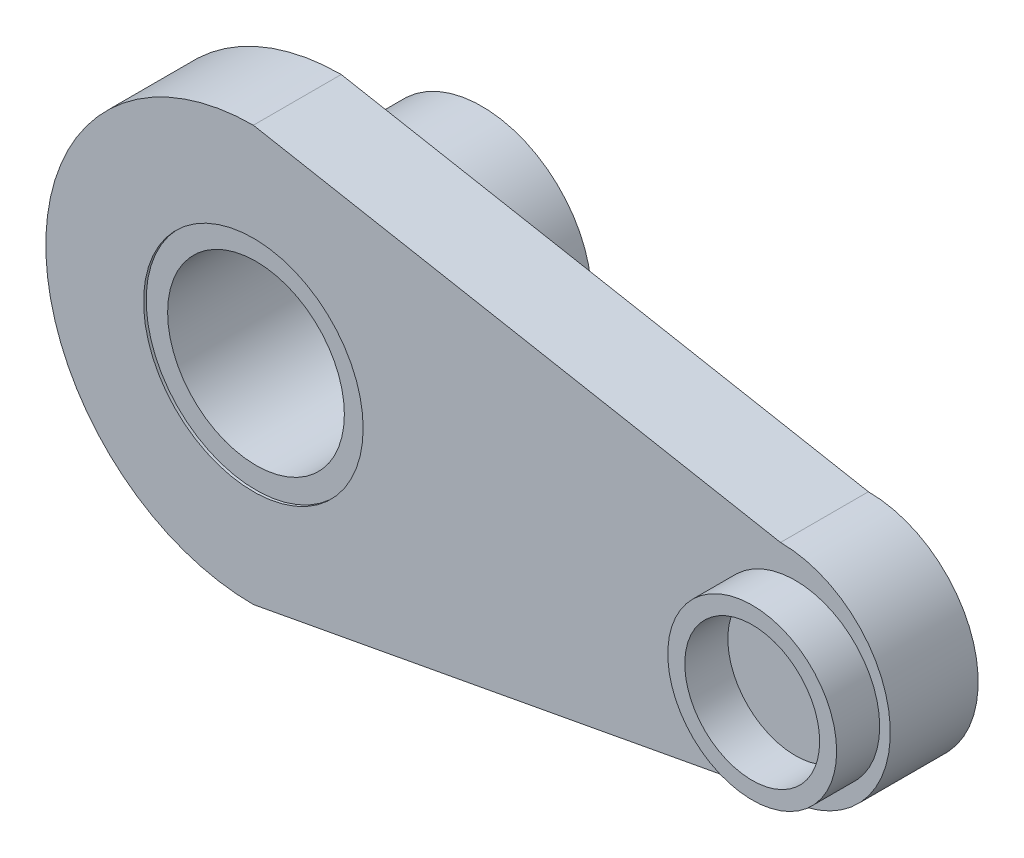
ISO-10303-21;
HEADER;
FILE_DESCRIPTION(('STEP AP214'),'2;1');
FILE_NAME('part.step','',(''),(''),'','','');
FILE_SCHEMA(('AUTOMOTIVE_DESIGN { 1 0 10303 214 1 1 1 1 }'));
ENDSEC;
DATA;
#1=APPLICATION_CONTEXT('core data for automotive mechanical design processes');
#2=APPLICATION_PROTOCOL_DEFINITION('international standard','automotive_design',2000,#1);
#3=PRODUCT_CONTEXT('',#1,'mechanical');
#4=PRODUCT('Part','Part','',(#3));
#5=PRODUCT_RELATED_PRODUCT_CATEGORY('part','',(#4));
#6=PRODUCT_DEFINITION_FORMATION('','',#4);
#7=PRODUCT_DEFINITION_CONTEXT('part definition',#1,'design');
#8=PRODUCT_DEFINITION('design','',#6,#7);
#9=PRODUCT_DEFINITION_SHAPE('','',#8);
#10=(LENGTH_UNIT() NAMED_UNIT(*) SI_UNIT(.MILLI.,.METRE.));
#11=(NAMED_UNIT(*) PLANE_ANGLE_UNIT() SI_UNIT($,.RADIAN.));
#12=(NAMED_UNIT(*) SI_UNIT($,.STERADIAN.) SOLID_ANGLE_UNIT());
#13=UNCERTAINTY_MEASURE_WITH_UNIT(LENGTH_MEASURE(1.E-05),#10,'distance_accuracy_value','');
#14=(GEOMETRIC_REPRESENTATION_CONTEXT(3) GLOBAL_UNCERTAINTY_ASSIGNED_CONTEXT((#13)) GLOBAL_UNIT_ASSIGNED_CONTEXT((#10,
#11,#12)) REPRESENTATION_CONTEXT('',''));
#15=CARTESIAN_POINT('',(0.,0.,0.));
#16=DIRECTION('',(0.,0.,1.));
#17=DIRECTION('',(1.,0.,0.));
#18=AXIS2_PLACEMENT_3D('',#15,#16,#17);
#19=CARTESIAN_POINT('',(15.1887409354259,-53.239975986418,0.));
#20=DIRECTION('',(0.,0.,1.));
#21=DIRECTION('',(1.,0.,0.));
#22=AXIS2_PLACEMENT_3D('',#19,#20,#21);
#23=PLANE('',#22);
#24=CARTESIAN_POINT('',(38.1,0.,0.));
#25=DIRECTION('',(0.,0.,1.));
#26=DIRECTION('',(1.,0.,0.));
#27=AXIS2_PLACEMENT_3D('',#24,#25,#26);
#28=CIRCLE('',#27,7.935);
#29=CARTESIAN_POINT('',(38.1,-7.93500000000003,0.));
#30=VERTEX_POINT('',#29);
#31=CARTESIAN_POINT('',(38.1,7.935,0.));
#32=VERTEX_POINT('',#31);
#33=EDGE_CURVE('E103',#30,#32,#28,.T.);
#34=ORIENTED_EDGE('',*,*,#33,.F.);
#35=DIRECTION('',(-0.983238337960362,-0.182324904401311,0.));
#36=VECTOR('',#35,1.);
#37=CARTESIAN_POINT('',(7.82859519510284,-13.5483195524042,0.));
#38=LINE('',#37,#36);
#39=CARTESIAN_POINT('',(0.,-15.,0.));
#40=VERTEX_POINT('',#39);
#41=EDGE_CURVE('E113',#30,#40,#38,.T.);
#42=ORIENTED_EDGE('',*,*,#41,.T.);
#43=CARTESIAN_POINT('',(0.,0.,0.));
#44=DIRECTION('',(0.,0.,1.));
#45=DIRECTION('',(1.,0.,0.));
#46=AXIS2_PLACEMENT_3D('',#43,#44,#45);
#47=CIRCLE('',#46,15.);
#48=CARTESIAN_POINT('',(0.,15.,0.));
#49=VERTEX_POINT('',#48);
#50=EDGE_CURVE('E111',#49,#40,#47,.T.);
#51=ORIENTED_EDGE('',*,*,#50,.F.);
#52=DIRECTION('',(0.983238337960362,-0.182324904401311,0.));
#53=VECTOR('',#52,1.);
#54=CARTESIAN_POINT('',(26.9171322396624,10.0086735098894,0.));
#55=LINE('',#54,#53);
#56=EDGE_CURVE('E96',#49,#32,#55,.T.);
#57=ORIENTED_EDGE('',*,*,#56,.T.);
#58=EDGE_LOOP('',(#34,#42,#51,#57));
#59=FACE_BOUND('',#58,.T.);
#60=CARTESIAN_POINT('',(0.,0.,0.));
#61=DIRECTION('',(0.,0.,1.));
#62=DIRECTION('',(1.,0.,0.));
#63=AXIS2_PLACEMENT_3D('',#60,#61,#62);
#64=CIRCLE('',#63,7.935);
#65=CARTESIAN_POINT('',(7.93500000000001,0.,0.));
#66=VERTEX_POINT('',#65);
#67=EDGE_CURVE('E13',#66,#66,#64,.F.);
#68=ORIENTED_EDGE('',*,*,#67,.F.);
#69=EDGE_LOOP('',(#68));
#70=FACE_BOUND('',#69,.T.);
#71=ADVANCED_FACE('F47',(#59,#70),#23,.F.);
#72=CARTESIAN_POINT('',(15.1887409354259,-53.239975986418,6.35000000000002));
#73=DIRECTION('',(0.,0.,1.));
#74=DIRECTION('',(1.,0.,0.));
#75=AXIS2_PLACEMENT_3D('',#72,#73,#74);
#76=PLANE('',#75);
#77=CARTESIAN_POINT('',(38.1,0.,6.35000000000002));
#78=DIRECTION('',(0.,0.,1.));
#79=DIRECTION('',(1.,0.,0.));
#80=AXIS2_PLACEMENT_3D('',#77,#78,#79);
#81=CIRCLE('',#80,7.935);
#82=CARTESIAN_POINT('',(38.1,-7.93500000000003,6.35000000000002));
#83=VERTEX_POINT('',#82);
#84=CARTESIAN_POINT('',(38.1,7.935,6.35000000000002));
#85=VERTEX_POINT('',#84);
#86=EDGE_CURVE('E118',#83,#85,#81,.T.);
#87=ORIENTED_EDGE('',*,*,#86,.T.);
#88=DIRECTION('',(0.983238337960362,-0.182324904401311,0.));
#89=VECTOR('',#88,1.);
#90=CARTESIAN_POINT('',(26.9171322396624,10.0086735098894,6.35000000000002));
#91=LINE('',#90,#89);
#92=CARTESIAN_POINT('',(0.,15.,6.35000000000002));
#93=VERTEX_POINT('',#92);
#94=EDGE_CURVE('E97',#93,#85,#91,.T.);
#95=ORIENTED_EDGE('',*,*,#94,.F.);
#96=CARTESIAN_POINT('',(0.,0.,6.35000000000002));
#97=DIRECTION('',(0.,0.,1.));
#98=DIRECTION('',(1.,0.,0.));
#99=AXIS2_PLACEMENT_3D('',#96,#97,#98);
#100=CIRCLE('',#99,15.);
#101=CARTESIAN_POINT('',(0.,-15.,6.35000000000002));
#102=VERTEX_POINT('',#101);
#103=EDGE_CURVE('E70',#93,#102,#100,.T.);
#104=ORIENTED_EDGE('',*,*,#103,.T.);
#105=DIRECTION('',(-0.983238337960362,-0.182324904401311,0.));
#106=VECTOR('',#105,1.);
#107=CARTESIAN_POINT('',(7.82859519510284,-13.5483195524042,6.35000000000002));
#108=LINE('',#107,#106);
#109=EDGE_CURVE('E122',#83,#102,#108,.T.);
#110=ORIENTED_EDGE('',*,*,#109,.F.);
#111=EDGE_LOOP('',(#87,#95,#104,#110));
#112=FACE_BOUND('',#111,.T.);
#113=CARTESIAN_POINT('',(0.,0.,6.35000000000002));
#114=DIRECTION('',(0.,0.,1.));
#115=DIRECTION('',(1.,0.,0.));
#116=AXIS2_PLACEMENT_3D('',#113,#114,#115);
#117=CIRCLE('',#116,7.935);
#118=CARTESIAN_POINT('',(7.93500000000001,0.,6.35000000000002));
#119=VERTEX_POINT('',#118);
#120=EDGE_CURVE('E124',#119,#119,#117,.T.);
#121=ORIENTED_EDGE('',*,*,#120,.F.);
#122=EDGE_LOOP('',(#121));
#123=FACE_BOUND('',#122,.T.);
#124=CARTESIAN_POINT('',(39.1648768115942,0.,6.35000000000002));
#125=DIRECTION('',(0.,0.,1.));
#126=DIRECTION('',(1.,0.,0.));
#127=AXIS2_PLACEMENT_3D('',#124,#125,#126);
#128=CIRCLE('',#127,6.10143424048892);
#129=CARTESIAN_POINT('',(45.2663110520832,0.,6.35000000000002));
#130=VERTEX_POINT('',#129);
#131=EDGE_CURVE('E153',#130,#130,#128,.T.);
#132=ORIENTED_EDGE('',*,*,#131,.F.);
#133=EDGE_LOOP('',(#132));
#134=FACE_BOUND('',#133,.T.);
#135=ADVANCED_FACE('F146',(#112,#123,#134),#76,.T.);
#136=CARTESIAN_POINT('',(38.1,0.,6.35000000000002));
#137=DIRECTION('',(0.,0.,-1.));
#138=DIRECTION('',(-1.,0.,0.));
#139=AXIS2_PLACEMENT_3D('',#136,#137,#138);
#140=CYLINDRICAL_SURFACE('',#139,7.935);
#141=ORIENTED_EDGE('',*,*,#33,.T.);
#142=DIRECTION('',(0.,0.,-1.));
#143=VECTOR('',#142,1.);
#144=CARTESIAN_POINT('',(38.1,7.935,6.35000000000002));
#145=LINE('',#144,#143);
#146=EDGE_CURVE('E92',#85,#32,#145,.T.);
#147=ORIENTED_EDGE('',*,*,#146,.F.);
#148=ORIENTED_EDGE('',*,*,#86,.F.);
#149=DIRECTION('',(0.,0.,-1.));
#150=VECTOR('',#149,1.);
#151=CARTESIAN_POINT('',(38.1,-7.93500000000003,6.35000000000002));
#152=LINE('',#151,#150);
#153=EDGE_CURVE('E62',#83,#30,#152,.T.);
#154=ORIENTED_EDGE('',*,*,#153,.T.);
#155=EDGE_LOOP('',(#141,#147,#148,#154));
#156=FACE_BOUND('',#155,.T.);
#157=ADVANCED_FACE('F49',(#156),#140,.T.);
#158=CARTESIAN_POINT('',(26.9171322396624,10.0086735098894,6.35000000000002));
#159=DIRECTION('',(0.182324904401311,0.983238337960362,0.));
#160=DIRECTION('',(-0.983238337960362,0.182324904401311,0.));
#161=AXIS2_PLACEMENT_3D('',#158,#159,#160);
#162=PLANE('',#161);
#163=ORIENTED_EDGE('',*,*,#56,.F.);
#164=DIRECTION('',(0.,0.,-1.));
#165=VECTOR('',#164,1.);
#166=CARTESIAN_POINT('',(0.,15.,6.35000000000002));
#167=LINE('',#166,#165);
#168=EDGE_CURVE('E100',#93,#49,#167,.T.);
#169=ORIENTED_EDGE('',*,*,#168,.F.);
#170=ORIENTED_EDGE('',*,*,#94,.T.);
#171=ORIENTED_EDGE('',*,*,#146,.T.);
#172=EDGE_LOOP('',(#163,#169,#170,#171));
#173=FACE_BOUND('',#172,.T.);
#174=ADVANCED_FACE('F94',(#173),#162,.T.);
#175=CARTESIAN_POINT('',(0.,0.,6.35000000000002));
#176=DIRECTION('',(0.,0.,-1.));
#177=DIRECTION('',(-1.,0.,0.));
#178=AXIS2_PLACEMENT_3D('',#175,#176,#177);
#179=CYLINDRICAL_SURFACE('',#178,15.);
#180=ORIENTED_EDGE('',*,*,#50,.T.);
#181=DIRECTION('',(0.,0.,-1.));
#182=VECTOR('',#181,1.);
#183=CARTESIAN_POINT('',(0.,-15.,6.35000000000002));
#184=LINE('',#183,#182);
#185=EDGE_CURVE('E128',#102,#40,#184,.T.);
#186=ORIENTED_EDGE('',*,*,#185,.F.);
#187=ORIENTED_EDGE('',*,*,#103,.F.);
#188=ORIENTED_EDGE('',*,*,#168,.T.);
#189=EDGE_LOOP('',(#180,#186,#187,#188));
#190=FACE_BOUND('',#189,.T.);
#191=ADVANCED_FACE('F199',(#190),#179,.T.);
#192=CARTESIAN_POINT('',(7.82859519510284,-13.5483195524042,6.35000000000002));
#193=DIRECTION('',(0.182324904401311,-0.983238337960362,0.));
#194=DIRECTION('',(0.983238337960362,0.182324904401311,0.));
#195=AXIS2_PLACEMENT_3D('',#192,#193,#194);
#196=PLANE('',#195);
#197=ORIENTED_EDGE('',*,*,#41,.F.);
#198=ORIENTED_EDGE('',*,*,#153,.F.);
#199=ORIENTED_EDGE('',*,*,#109,.T.);
#200=ORIENTED_EDGE('',*,*,#185,.T.);
#201=EDGE_LOOP('',(#197,#198,#199,#200));
#202=FACE_BOUND('',#201,.T.);
#203=ADVANCED_FACE('F142',(#202),#196,.T.);
#204=CARTESIAN_POINT('',(0.,0.,6.35000000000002));
#205=DIRECTION('',(0.,0.,-1.));
#206=DIRECTION('',(-1.,0.,0.));
#207=AXIS2_PLACEMENT_3D('',#204,#205,#206);
#208=CYLINDRICAL_SURFACE('',#207,7.935);
#209=CARTESIAN_POINT('',(0.,0.,6.16000000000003));
#210=DIRECTION('',(0.,0.,1.));
#211=DIRECTION('',(1.,0.,0.));
#212=AXIS2_PLACEMENT_3D('',#209,#210,#211);
#213=CIRCLE('',#212,7.935);
#214=CARTESIAN_POINT('',(7.93500000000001,0.,6.16000000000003));
#215=VERTEX_POINT('',#214);
#216=EDGE_CURVE('E55',#215,#215,#213,.T.);
#217=ORIENTED_EDGE('',*,*,#216,.F.);
#218=EDGE_LOOP('',(#217));
#219=FACE_BOUND('',#218,.T.);
#220=ORIENTED_EDGE('',*,*,#120,.T.);
#221=EDGE_LOOP('',(#220));
#222=FACE_BOUND('',#221,.T.);
#223=ADVANCED_FACE('F138',(#219,#222),#208,.F.);
#224=CARTESIAN_POINT('',(39.1648768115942,0.,9.46143401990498));
#225=DIRECTION('',(0.,0.,1.));
#226=DIRECTION('',(1.,0.,0.));
#227=AXIS2_PLACEMENT_3D('',#224,#225,#226);
#228=PLANE('',#227);
#229=CARTESIAN_POINT('',(39.1648768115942,0.,9.46143401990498));
#230=DIRECTION('',(0.,0.,1.));
#231=DIRECTION('',(1.,0.,0.));
#232=AXIS2_PLACEMENT_3D('',#229,#230,#231);
#233=CIRCLE('',#232,6.10143424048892);
#234=CARTESIAN_POINT('',(45.2663110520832,0.,9.46143401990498));
#235=VERTEX_POINT('',#234);
#236=EDGE_CURVE('E106',#235,#235,#233,.T.);
#237=ORIENTED_EDGE('',*,*,#236,.T.);
#238=EDGE_LOOP('',(#237));
#239=FACE_BOUND('',#238,.T.);
#240=CARTESIAN_POINT('',(39.1648768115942,0.,9.46143401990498));
#241=DIRECTION('',(0.,0.,1.));
#242=DIRECTION('',(1.,0.,0.));
#243=AXIS2_PLACEMENT_3D('',#240,#241,#242);
#244=CIRCLE('',#243,4.87323276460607);
#245=CARTESIAN_POINT('',(44.0381095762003,0.,9.46143401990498));
#246=VERTEX_POINT('',#245);
#247=EDGE_CURVE('E155',#246,#246,#244,.T.);
#248=ORIENTED_EDGE('',*,*,#247,.F.);
#249=EDGE_LOOP('',(#248));
#250=FACE_BOUND('',#249,.T.);
#251=ADVANCED_FACE('F141',(#239,#250),#228,.T.);
#252=CARTESIAN_POINT('',(39.1648768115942,0.,9.46143401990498));
#253=DIRECTION('',(0.,0.,-1.));
#254=DIRECTION('',(-1.,0.,0.));
#255=AXIS2_PLACEMENT_3D('',#252,#253,#254);
#256=CYLINDRICAL_SURFACE('',#255,6.10143424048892);
#257=ORIENTED_EDGE('',*,*,#236,.F.);
#258=EDGE_LOOP('',(#257));
#259=FACE_BOUND('',#258,.T.);
#260=ORIENTED_EDGE('',*,*,#131,.T.);
#261=EDGE_LOOP('',(#260));
#262=FACE_BOUND('',#261,.T.);
#263=ADVANCED_FACE('F191',(#259,#262),#256,.T.);
#264=CARTESIAN_POINT('',(39.1648768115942,0.,9.46143401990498));
#265=DIRECTION('',(0.,0.,-1.));
#266=DIRECTION('',(-1.,0.,0.));
#267=AXIS2_PLACEMENT_3D('',#264,#265,#266);
#268=CYLINDRICAL_SURFACE('',#267,4.87323276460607);
#269=ORIENTED_EDGE('',*,*,#247,.T.);
#270=EDGE_LOOP('',(#269));
#271=FACE_BOUND('',#270,.T.);
#272=CARTESIAN_POINT('',(39.1648768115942,0.,6.35000000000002));
#273=DIRECTION('',(0.,0.,1.));
#274=DIRECTION('',(1.,0.,0.));
#275=AXIS2_PLACEMENT_3D('',#272,#273,#274);
#276=CIRCLE('',#275,4.87323276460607);
#277=CARTESIAN_POINT('',(44.0381095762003,0.,6.35000000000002));
#278=VERTEX_POINT('',#277);
#279=EDGE_CURVE('E99',#278,#278,#276,.F.);
#280=ORIENTED_EDGE('',*,*,#279,.T.);
#281=EDGE_LOOP('',(#280));
#282=FACE_BOUND('',#281,.T.);
#283=ADVANCED_FACE('F194',(#271,#282),#268,.F.);
#284=ORIENTED_EDGE('',*,*,#279,.F.);
#285=EDGE_LOOP('',(#284));
#286=FACE_BOUND('',#285,.T.);
#287=ADVANCED_FACE('F150',(#286),#76,.T.);
#288=CARTESIAN_POINT('',(0.,0.,6.16000000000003));
#289=DIRECTION('',(0.,0.,1.));
#290=DIRECTION('',(1.,0.,0.));
#291=AXIS2_PLACEMENT_3D('',#288,#289,#290);
#292=PLANE('',#291);
#293=ORIENTED_EDGE('',*,*,#216,.T.);
#294=EDGE_LOOP('',(#293));
#295=FACE_BOUND('',#294,.T.);
#296=CARTESIAN_POINT('',(0.,0.,6.16000000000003));
#297=DIRECTION('',(0.,0.,1.));
#298=DIRECTION('',(1.,0.,0.));
#299=AXIS2_PLACEMENT_3D('',#296,#297,#298);
#300=CIRCLE('',#299,6.38700131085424);
#301=CARTESIAN_POINT('',(6.38700131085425,0.,6.16000000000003));
#302=VERTEX_POINT('',#301);
#303=EDGE_CURVE('E159',#302,#302,#300,.T.);
#304=ORIENTED_EDGE('',*,*,#303,.F.);
#305=EDGE_LOOP('',(#304));
#306=FACE_BOUND('',#305,.T.);
#307=ADVANCED_FACE('F135',(#295,#306),#292,.T.);
#308=CARTESIAN_POINT('',(0.,0.,6.16000000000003));
#309=DIRECTION('',(0.,0.,-1.));
#310=DIRECTION('',(-1.,0.,0.));
#311=AXIS2_PLACEMENT_3D('',#308,#309,#310);
#312=CYLINDRICAL_SURFACE('',#311,6.38700131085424);
#313=ORIENTED_EDGE('',*,*,#303,.T.);
#314=EDGE_LOOP('',(#313));
#315=FACE_BOUND('',#314,.T.);
#316=CARTESIAN_POINT('',(0.,0.,-10.16));
#317=DIRECTION('',(0.,0.,-1.));
#318=DIRECTION('',(-1.,0.,0.));
#319=AXIS2_PLACEMENT_3D('',#316,#317,#318);
#320=CIRCLE('',#319,6.38700131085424);
#321=CARTESIAN_POINT('',(-6.38700131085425,0.,-10.16));
#322=VERTEX_POINT('',#321);
#323=EDGE_CURVE('E167',#322,#322,#320,.T.);
#324=ORIENTED_EDGE('',*,*,#323,.T.);
#325=EDGE_LOOP('',(#324));
#326=FACE_BOUND('',#325,.T.);
#327=ADVANCED_FACE('F171',(#315,#326),#312,.F.);
#328=CARTESIAN_POINT('',(0.,0.,-10.16));
#329=DIRECTION('',(0.,0.,-1.));
#330=DIRECTION('',(-1.,0.,0.));
#331=AXIS2_PLACEMENT_3D('',#328,#329,#330);
#332=PLANE('',#331);
#333=CARTESIAN_POINT('',(0.,0.,-10.16));
#334=DIRECTION('',(0.,0.,-1.));
#335=DIRECTION('',(-1.,0.,0.));
#336=AXIS2_PLACEMENT_3D('',#333,#334,#335);
#337=CIRCLE('',#336,7.935);
#338=CARTESIAN_POINT('',(-7.93500000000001,0.,-10.16));
#339=VERTEX_POINT('',#338);
#340=EDGE_CURVE('E164',#339,#339,#337,.T.);
#341=ORIENTED_EDGE('',*,*,#340,.T.);
#342=EDGE_LOOP('',(#341));
#343=FACE_BOUND('',#342,.T.);
#344=ORIENTED_EDGE('',*,*,#323,.F.);
#345=EDGE_LOOP('',(#344));
#346=FACE_BOUND('',#345,.T.);
#347=ADVANCED_FACE('F173',(#343,#346),#332,.T.);
#348=CARTESIAN_POINT('',(0.,0.,-10.16));
#349=DIRECTION('',(0.,0.,1.));
#350=DIRECTION('',(1.,0.,0.));
#351=AXIS2_PLACEMENT_3D('',#348,#349,#350);
#352=CYLINDRICAL_SURFACE('',#351,7.935);
#353=ORIENTED_EDGE('',*,*,#340,.F.);
#354=EDGE_LOOP('',(#353));
#355=FACE_BOUND('',#354,.T.);
#356=ORIENTED_EDGE('',*,*,#67,.T.);
#357=EDGE_LOOP('',(#356));
#358=FACE_BOUND('',#357,.T.);
#359=ADVANCED_FACE('F175',(#355,#358),#352,.T.);
#360=CLOSED_SHELL('',(#71,#135,#157,#174,#191,#203,#223,#251,#263,#283,#287,#307,#327,#347,#359));
#361=MANIFOLD_SOLID_BREP('B2',#360);
#362=ADVANCED_BREP_SHAPE_REPRESENTATION('',(#18,#361),#14);
#363=SHAPE_DEFINITION_REPRESENTATION(#9,#362);
ENDSEC;
END-ISO-10303-21;
